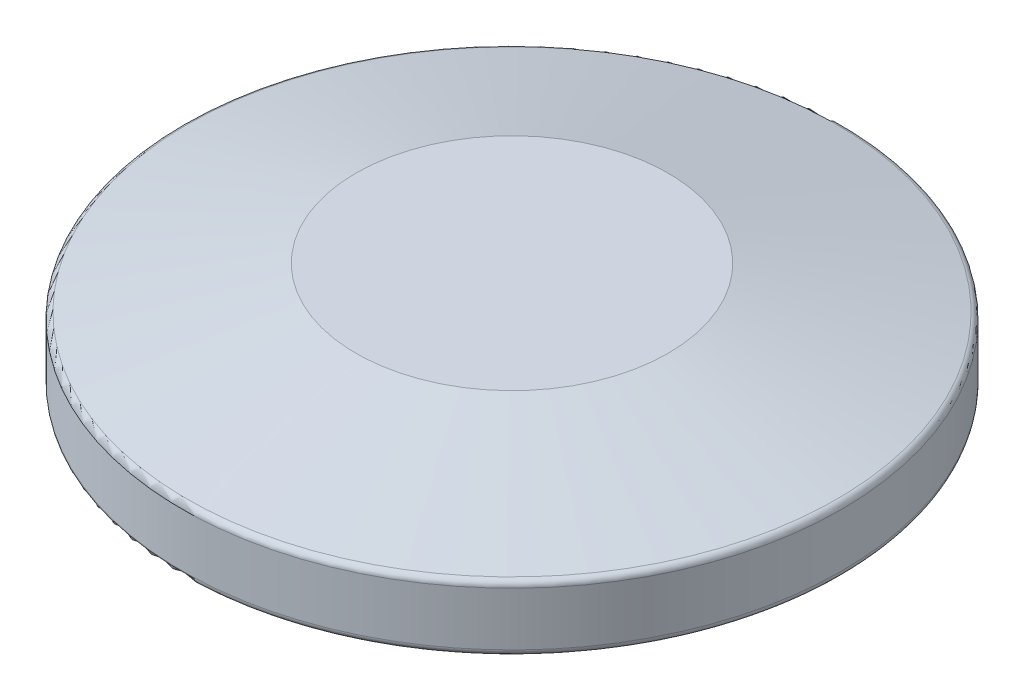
from build123d import *

# Parameters (mm, degrees)
FILLET_1_R = 0.3
FILLET_2_R = 0.3
FILLET_3_R = 0.3
FILLET_4_R = 0.1


with BuildPart() as part:
    # Sketch 1 → Revolve 2 (revolve)
    with BuildSketch(Plane.XY):
        Polygon((-6.2, 2.5), (-3.625, 2.5), (-3.625, 0), (0, 0), (0, 5), (-7.2, 5), (-15.2, 3), (-15.2, 0), (-6.2, 0), align=None)
    revolve(axis=Axis((0, 5, 0), (0, -1, 0)))

    # Fillet 1
    fillet_1_edges = [part.edges().sort_by_distance(p)[0] for p in [
        (15.2, 3, 0),
    ]]
    fillet(fillet_1_edges, radius=FILLET_1_R)

    # Fillet 2
    fillet_2_edges = [part.edges().sort_by_distance(p)[0] for p in [
        (15.2, 0, 0),
    ]]
    fillet(fillet_2_edges, radius=FILLET_2_R)

    # Fillet 3
    fillet_3_edges = [part.edges().sort_by_distance(p)[0] for p in [
        (6.2, 0, 0),
    ]]
    fillet(fillet_3_edges, radius=FILLET_3_R)

    # Fillet 4
    fillet_4_edges = [part.edges().sort_by_distance(p)[0] for p in [
        (3.625, 0, 0),
    ]]
    fillet(fillet_4_edges, radius=FILLET_4_R)


solid = part.part
